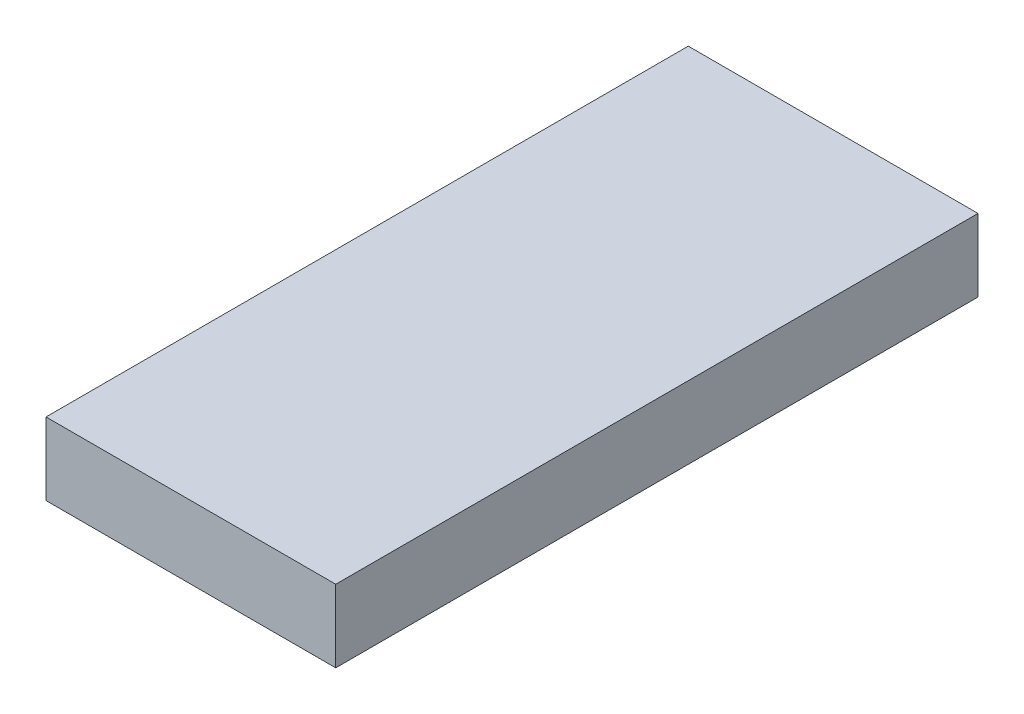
from build123d import *

# Parameters (mm, degrees)
ESQUISSE1_W      = 60
ESQUISSE1_H      = 15
EXTRUSION1_DEPTH = 133


with BuildPart() as part:
    # Esquisse1 → Extrusion1 (new body)
    with BuildSketch(Plane.XY):
        with Locations((30, 7.5)):
            Rectangle(ESQUISSE1_W, ESQUISSE1_H)
    extrude(amount=EXTRUSION1_DEPTH)


solid = part.part
